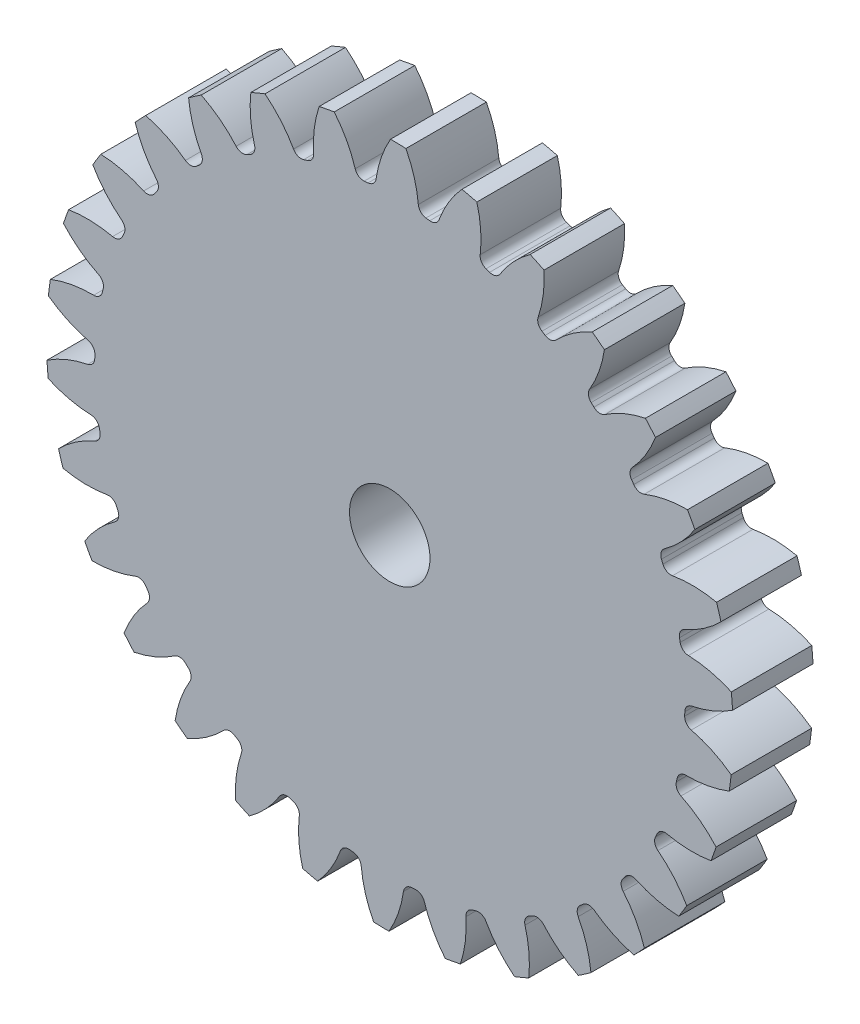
from build123d import *

# Parameters (mm, degrees)
SKETCH3_R         = 541.866666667
GEARBODY_DEPTH    = 127
TOOTHCUT_DEPTH    = 777.767641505
CIRPATTERN1_COUNT = 30
BOREDIA_R         = 63.5
BORE_DEPTH        = 12700


with BuildPart() as part:
    # Sketch3 → gearBody (new body)
    with BuildSketch(Plane.XY):
        Circle(SKETCH3_R)
    extrude(amount=GEARBODY_DEPTH)

    # Sketch2 → toothCut (cut, through all)
    with BuildSketch(Plane.XY):
        with BuildLine():
            ThreePointArc((465.441517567, -14.478887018), (465.525051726, -11.4834951), (465.589308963, -8.487627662))
            ThreePointArc((465.589308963, -8.487627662), (468.789955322, 0.095052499), (476.663436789, 4.776379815))
            ThreePointArc((476.663436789, 4.776379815), (510.594379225, 15.10912908), (541.866666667, 31.845873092))
            ThreePointArc((541.866666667, 31.845873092), (542.636589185, -13.385669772), (539.6374317, -58.524237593))
            ThreePointArc((539.6374317, -58.524237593), (509.228395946, -40.265948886), (475.848185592, -28.27277922))
            ThreePointArc((475.848185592, -28.27277922), (468.215096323, -23.208938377), (465.441517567, -14.478887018))
        make_face()
    toothcut = extrude(amount=TOOTHCUT_DEPTH, mode=Mode.SUBTRACT)

    # CirPattern1: toothCut ×30 about axis
    cirpattern1_axis = Axis((0, 0, 0), (0, 0, 1))
    for i in range(1, CIRPATTERN1_COUNT):
        add(toothcut.rotate(cirpattern1_axis, i * 360 / CIRPATTERN1_COUNT), mode=Mode.SUBTRACT)

    # boreDia → bore (cut, symmetric)
    with BuildSketch(Plane.XY):
        Circle(BOREDIA_R)
    extrude(amount=BORE_DEPTH, both=True, mode=Mode.SUBTRACT)


solid = part.part
